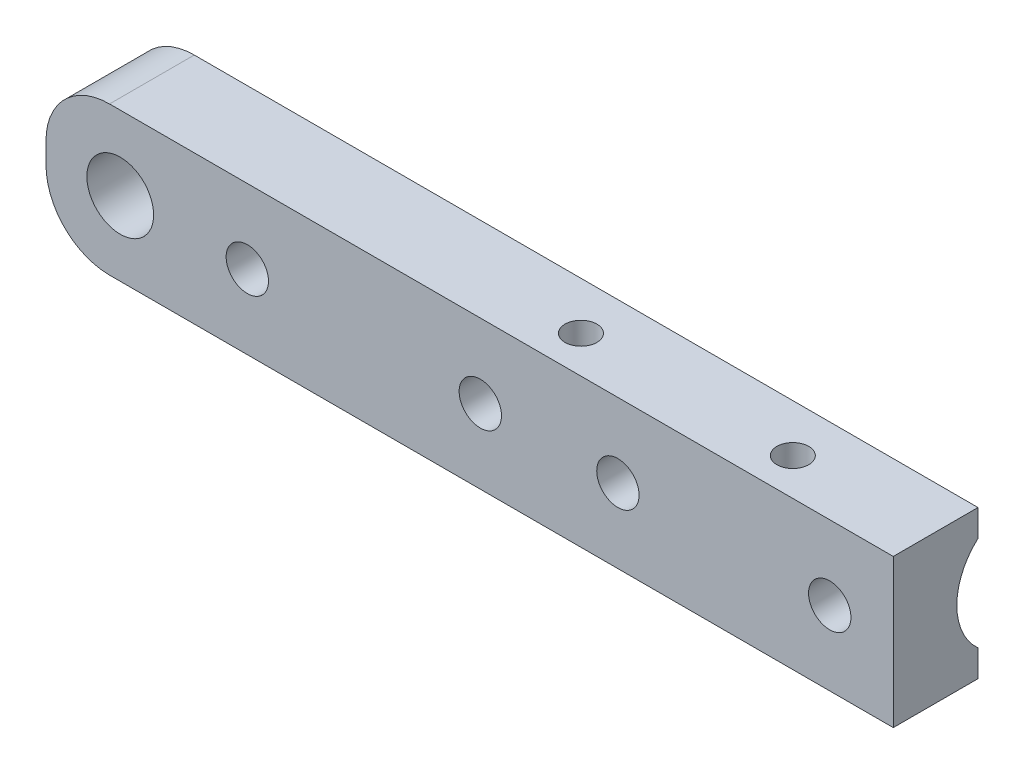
from build123d import *

# Parameters (mm, degrees)
SKETCH1_W           = 127
SKETCH1_H           = 22.225
SKETCH1_R           = 5.0038
SKETCH1_R_2         = 3.175
BOSS_EXTRUDE1_DEPTH = 6.35
FILLET1_R           = 9.525
SKETCH2_R           = 9.525
CUT_EXTRUDE1_DEPTH  = 50.8
SKETCH3_R           = 2.3876
CUT_EXTRUDE2_DEPTH  = 12.7


with BuildPart() as part:
    # Sketch1 → Boss-Extrude1 (new, symmetric)
    with BuildSketch(Plane.XY):
        with Locations((52.3748, 0)):
            Rectangle(SKETCH1_W, SKETCH1_H)
        Circle(SKETCH1_R, mode=Mode.SUBTRACT)
        with Locations((106.3498, 0)):
            Circle(SKETCH1_R_2, mode=Mode.SUBTRACT)
        with Locations((74.5998, 0)):
            Circle(SKETCH1_R_2, mode=Mode.SUBTRACT)
        with Locations((19.05, 0)):
            Circle(SKETCH1_R_2, mode=Mode.SUBTRACT)
        with Locations((53.975, 0)):
            Circle(SKETCH1_R_2, mode=Mode.SUBTRACT)
    extrude(amount=BOSS_EXTRUDE1_DEPTH, both=True)

    # Fillet1
    fillet1_edges = [part.edges().sort_by_distance(p)[0] for p in [
        (-11.1252, 11.1125, 0),
        (-11.1252, -11.1125, 0),
    ]]
    fillet(fillet1_edges, radius=FILLET1_R)

    # Sketch2 → Cut-Extrude1 (cut)
    with BuildSketch(Plane(origin=(115.8748, 0, 0), x_dir=(0, 0, -1), z_dir=(1, 0, 0))):
        with Locations((12.7, 0)):
            Circle(SKETCH2_R)
    extrude(amount=-CUT_EXTRUDE1_DEPTH, mode=Mode.SUBTRACT)

    # Sketch3 → Cut-Extrude2 (cut, symmetric)
    with BuildSketch(Plane(origin=(0, 0, 0), x_dir=(1, 0, 0), z_dir=(0, 1, 0))):
        with Locations(Location((63.5, -0.7874, 0), (0, 0, 90))):
            Circle(SKETCH3_R)
        with Locations(Location((95.25, -0.7874, 0), (0, 0, 90))):
            Circle(SKETCH3_R)
    extrude(amount=CUT_EXTRUDE2_DEPTH, both=True, mode=Mode.SUBTRACT)


solid = part.part
